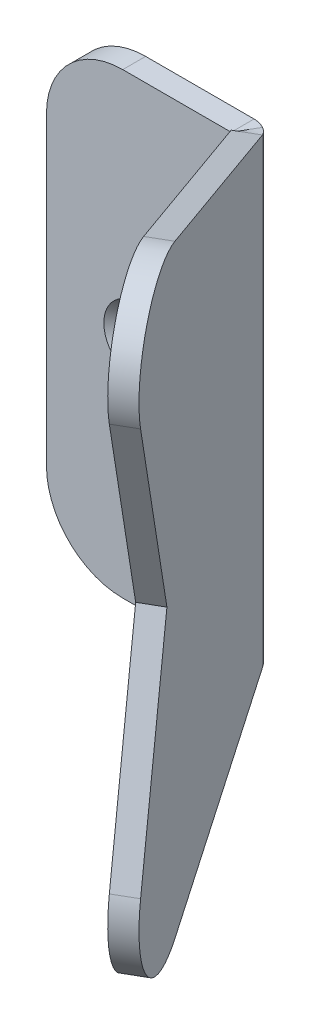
ISO-10303-21;
HEADER;
FILE_DESCRIPTION(('STEP AP214'),'2;1');
FILE_NAME('part.step','',(''),(''),'','','');
FILE_SCHEMA(('AUTOMOTIVE_DESIGN { 1 0 10303 214 1 1 1 1 }'));
ENDSEC;
DATA;
#1=APPLICATION_CONTEXT('core data for automotive mechanical design processes');
#2=APPLICATION_PROTOCOL_DEFINITION('international standard','automotive_design',2000,#1);
#3=PRODUCT_CONTEXT('',#1,'mechanical');
#4=PRODUCT('Part','Part','',(#3));
#5=PRODUCT_RELATED_PRODUCT_CATEGORY('part','',(#4));
#6=PRODUCT_DEFINITION_FORMATION('','',#4);
#7=PRODUCT_DEFINITION_CONTEXT('part definition',#1,'design');
#8=PRODUCT_DEFINITION('design','',#6,#7);
#9=PRODUCT_DEFINITION_SHAPE('','',#8);
#10=(LENGTH_UNIT() NAMED_UNIT(*) SI_UNIT(.MILLI.,.METRE.));
#11=(NAMED_UNIT(*) PLANE_ANGLE_UNIT() SI_UNIT($,.RADIAN.));
#12=(NAMED_UNIT(*) SI_UNIT($,.STERADIAN.) SOLID_ANGLE_UNIT());
#13=UNCERTAINTY_MEASURE_WITH_UNIT(LENGTH_MEASURE(1.E-05),#10,'distance_accuracy_value','');
#14=(GEOMETRIC_REPRESENTATION_CONTEXT(3) GLOBAL_UNCERTAINTY_ASSIGNED_CONTEXT((#13)) GLOBAL_UNIT_ASSIGNED_CONTEXT((#10,
#11,#12)) REPRESENTATION_CONTEXT('',''));
#15=CARTESIAN_POINT('',(0.,0.,0.));
#16=DIRECTION('',(0.,0.,1.));
#17=DIRECTION('',(1.,0.,0.));
#18=AXIS2_PLACEMENT_3D('',#15,#16,#17);
#19=CARTESIAN_POINT('',(43.9200595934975,30.,28.1307609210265));
#20=DIRECTION('',(-0.86602540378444,0.,0.499999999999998));
#21=DIRECTION('',(0.499999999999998,0.,0.86602540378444));
#22=AXIS2_PLACEMENT_3D('',#19,#20,#21);
#23=PLANE('',#22);
#24=DIRECTION('',(0.479157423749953,-0.285714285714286,0.829925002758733));
#25=VECTOR('',#24,1.);
#26=CARTESIAN_POINT('',(26.4200595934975,-30.,-2.18012821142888));
#27=LINE('',#26,#25);
#28=CARTESIAN_POINT('',(26.8130204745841,-30.2343165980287,-1.49949999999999));
#29=VERTEX_POINT('',#28);
#30=CARTESIAN_POINT('',(42.491488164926,-39.5831484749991,25.6564026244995));
#31=VERTEX_POINT('',#30);
#32=EDGE_CURVE('E141',#29,#31,#27,.T.);
#33=ORIENTED_EDGE('',*,*,#32,.F.);
#34=DIRECTION('',(0.,1.,0.));
#35=VECTOR('',#34,1.);
#36=CARTESIAN_POINT('',(26.8130204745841,30.,-1.49949999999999));
#37=LINE('',#36,#35);
#38=CARTESIAN_POINT('',(26.8130204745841,30.2343165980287,-1.49949999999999));
#39=VERTEX_POINT('',#38);
#40=EDGE_CURVE('E140',#29,#39,#37,.T.);
#41=ORIENTED_EDGE('',*,*,#40,.T.);
#42=DIRECTION('',(-0.479157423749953,-0.285714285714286,-0.829925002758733));
#43=VECTOR('',#42,1.);
#44=CARTESIAN_POINT('',(26.4200595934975,30.,-2.18012821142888));
#45=LINE('',#44,#43);
#46=CARTESIAN_POINT('',(42.491488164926,39.5831484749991,25.6564026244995));
#47=VERTEX_POINT('',#46);
#48=EDGE_CURVE('E125',#47,#39,#45,.T.);
#49=ORIENTED_EDGE('',*,*,#48,.F.);
#50=CARTESIAN_POINT('',(43.9200595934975,30.,28.1307609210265));
#51=DIRECTION('',(-0.86602540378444,0.,0.499999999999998));
#52=DIRECTION('',(0.499999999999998,0.,0.86602540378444));
#53=AXIS2_PLACEMENT_3D('',#50,#51,#52);
#54=CIRCLE('',#53,10.);
#55=CARTESIAN_POINT('',(48.6341048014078,26.6666666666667,36.2957267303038));
#56=VERTEX_POINT('',#55);
#57=EDGE_CURVE('E139',#56,#47,#54,.T.);
#58=ORIENTED_EDGE('',*,*,#57,.F.);
#59=DIRECTION('',(0.166666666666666,0.942809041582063,0.288675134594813));
#60=VECTOR('',#59,1.);
#61=CARTESIAN_POINT('',(48.6341048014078,26.6666666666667,36.2957267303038));
#62=LINE('',#61,#60);
#63=CARTESIAN_POINT('',(43.9200595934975,0.,28.1307609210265));
#64=VERTEX_POINT('',#63);
#65=EDGE_CURVE('E144',#64,#56,#62,.T.);
#66=ORIENTED_EDGE('',*,*,#65,.F.);
#67=DIRECTION('',(-0.166666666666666,0.942809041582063,-0.288675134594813));
#68=VECTOR('',#67,1.);
#69=CARTESIAN_POINT('',(48.6341048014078,-26.6666666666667,36.2957267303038));
#70=LINE('',#69,#68);
#71=CARTESIAN_POINT('',(48.6341048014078,-26.6666666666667,36.2957267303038));
#72=VERTEX_POINT('',#71);
#73=EDGE_CURVE('E146',#72,#64,#70,.T.);
#74=ORIENTED_EDGE('',*,*,#73,.F.);
#75=CARTESIAN_POINT('',(43.9200595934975,-30.,28.1307609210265));
#76=DIRECTION('',(-0.86602540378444,0.,0.499999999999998));
#77=DIRECTION('',(-0.499999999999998,0.,-0.86602540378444));
#78=AXIS2_PLACEMENT_3D('',#75,#76,#77);
#79=CIRCLE('',#78,10.);
#80=EDGE_CURVE('E150',#31,#72,#79,.T.);
#81=ORIENTED_EDGE('',*,*,#80,.F.);
#82=EDGE_LOOP('',(#33,#41,#49,#58,#66,#74,#81));
#83=FACE_BOUND('',#82,.T.);
#84=ADVANCED_FACE('F54',(#83),#23,.F.);
#85=CARTESIAN_POINT('',(48.6341048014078,-26.6666666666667,36.2957267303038));
#86=DIRECTION('',(0.47140452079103,0.333333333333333,0.816496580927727));
#87=DIRECTION('',(-0.166666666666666,0.942809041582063,-0.288675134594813));
#88=AXIS2_PLACEMENT_3D('',#85,#86,#87);
#89=PLANE('',#88);
#90=DIRECTION('',(-0.166666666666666,0.942809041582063,-0.288675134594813));
#91=VECTOR('',#90,1.);
#92=CARTESIAN_POINT('',(46.0360285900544,-26.6666666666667,37.7957267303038));
#93=LINE('',#92,#91);
#94=CARTESIAN_POINT('',(46.0360285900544,-26.6666666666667,37.7957267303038));
#95=VERTEX_POINT('',#94);
#96=CARTESIAN_POINT('',(41.3219833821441,0.,29.6307609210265));
#97=VERTEX_POINT('',#96);
#98=EDGE_CURVE('E152',#95,#97,#93,.T.);
#99=ORIENTED_EDGE('',*,*,#98,.F.);
#100=DIRECTION('',(-0.86602540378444,0.,0.499999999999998));
#101=VECTOR('',#100,1.);
#102=CARTESIAN_POINT('',(48.6341048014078,-26.6666666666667,36.2957267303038));
#103=LINE('',#102,#101);
#104=EDGE_CURVE('E81',#72,#95,#103,.T.);
#105=ORIENTED_EDGE('',*,*,#104,.F.);
#106=ORIENTED_EDGE('',*,*,#73,.T.);
#107=DIRECTION('',(-0.86602540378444,0.,0.499999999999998));
#108=VECTOR('',#107,1.);
#109=CARTESIAN_POINT('',(43.9200595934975,0.,28.1307609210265));
#110=LINE('',#109,#108);
#111=EDGE_CURVE('E111',#64,#97,#110,.T.);
#112=ORIENTED_EDGE('',*,*,#111,.T.);
#113=EDGE_LOOP('',(#99,#105,#106,#112));
#114=FACE_BOUND('',#113,.T.);
#115=ADVANCED_FACE('F353',(#114),#89,.T.);
#116=CARTESIAN_POINT('',(43.9200595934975,-30.,28.1307609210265));
#117=DIRECTION('',(-0.86602540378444,0.,0.499999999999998));
#118=DIRECTION('',(0.499999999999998,0.,0.86602540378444));
#119=AXIS2_PLACEMENT_3D('',#116,#117,#118);
#120=CYLINDRICAL_SURFACE('',#119,10.);
#121=CARTESIAN_POINT('',(41.3219833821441,-30.,29.6307609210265));
#122=DIRECTION('',(-0.86602540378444,0.,0.499999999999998));
#123=DIRECTION('',(-0.499999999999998,0.,-0.86602540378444));
#124=AXIS2_PLACEMENT_3D('',#121,#122,#123);
#125=CIRCLE('',#124,10.);
#126=CARTESIAN_POINT('',(39.8934119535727,-39.5831484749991,27.1564026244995));
#127=VERTEX_POINT('',#126);
#128=EDGE_CURVE('E161',#127,#95,#125,.T.);
#129=ORIENTED_EDGE('',*,*,#128,.F.);
#130=DIRECTION('',(-0.86602540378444,0.,0.499999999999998));
#131=VECTOR('',#130,1.);
#132=CARTESIAN_POINT('',(42.491488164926,-39.5831484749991,25.6564026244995));
#133=LINE('',#132,#131);
#134=EDGE_CURVE('E132',#31,#127,#133,.T.);
#135=ORIENTED_EDGE('',*,*,#134,.F.);
#136=ORIENTED_EDGE('',*,*,#80,.T.);
#137=ORIENTED_EDGE('',*,*,#104,.T.);
#138=EDGE_LOOP('',(#129,#135,#136,#137));
#139=FACE_BOUND('',#138,.T.);
#140=ADVANCED_FACE('F197',(#139),#120,.T.);
#141=CARTESIAN_POINT('',(26.4200595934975,-30.,-2.18012821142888));
#142=DIRECTION('',(-0.142857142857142,-0.95831484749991,-0.247435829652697));
#143=DIRECTION('',(0.479157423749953,-0.285714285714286,0.829925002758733));
#144=AXIS2_PLACEMENT_3D('',#141,#142,#143);
#145=PLANE('',#144);
#146=CARTESIAN_POINT('',(26.8130204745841,-30.2343165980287,-1.49949999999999));
#147=CARTESIAN_POINT('',(24.2149442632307,-30.2343165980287,0.000500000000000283));
#148=B_SPLINE_CURVE_WITH_KNOTS('',1,(#146,#147),.UNSPECIFIED.,.F.,.F.,(2,2),(0.,1.),.UNSPECIFIED.);
#149=CARTESIAN_POINT('',(24.2149442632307,-30.2343165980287,0.00050000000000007));
#150=VERTEX_POINT('',#149);
#151=EDGE_CURVE('E319',#29,#150,#148,.T.);
#152=ORIENTED_EDGE('',*,*,#151,.F.);
#153=ORIENTED_EDGE('',*,*,#32,.T.);
#154=ORIENTED_EDGE('',*,*,#134,.T.);
#155=DIRECTION('',(0.479157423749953,-0.285714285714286,0.829925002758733));
#156=VECTOR('',#155,1.);
#157=CARTESIAN_POINT('',(23.8219833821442,-30.,-0.68012821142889));
#158=LINE('',#157,#156);
#159=EDGE_CURVE('E164',#150,#127,#158,.T.);
#160=ORIENTED_EDGE('',*,*,#159,.F.);
#161=EDGE_LOOP('',(#152,#153,#154,#160));
#162=FACE_BOUND('',#161,.T.);
#163=ADVANCED_FACE('F193',(#162),#145,.T.);
#164=CARTESIAN_POINT('',(26.4200595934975,30.,-2.18012821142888));
#165=DIRECTION('',(-0.142857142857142,0.95831484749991,-0.247435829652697));
#166=DIRECTION('',(-0.479157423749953,-0.285714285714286,-0.829925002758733));
#167=AXIS2_PLACEMENT_3D('',#164,#165,#166);
#168=PLANE('',#167);
#169=CARTESIAN_POINT('',(24.2149442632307,30.2343165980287,0.000499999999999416));
#170=CARTESIAN_POINT('',(26.8130204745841,30.2343165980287,-1.49949999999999));
#171=B_SPLINE_CURVE_WITH_KNOTS('',1,(#169,#170),.UNSPECIFIED.,.F.,.F.,(2,2),(0.,1.),.UNSPECIFIED.);
#172=CARTESIAN_POINT('',(24.2149442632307,30.2343165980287,0.000500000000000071));
#173=VERTEX_POINT('',#172);
#174=EDGE_CURVE('E12',#173,#39,#171,.T.);
#175=ORIENTED_EDGE('',*,*,#174,.F.);
#176=DIRECTION('',(-0.479157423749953,-0.285714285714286,-0.829925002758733));
#177=VECTOR('',#176,1.);
#178=CARTESIAN_POINT('',(23.8219833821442,30.,-0.68012821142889));
#179=LINE('',#178,#177);
#180=CARTESIAN_POINT('',(39.8934119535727,39.5831484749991,27.1564026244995));
#181=VERTEX_POINT('',#180);
#182=EDGE_CURVE('E127',#181,#173,#179,.T.);
#183=ORIENTED_EDGE('',*,*,#182,.F.);
#184=DIRECTION('',(-0.86602540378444,0.,0.499999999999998));
#185=VECTOR('',#184,1.);
#186=CARTESIAN_POINT('',(42.491488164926,39.5831484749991,25.6564026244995));
#187=LINE('',#186,#185);
#188=EDGE_CURVE('E122',#47,#181,#187,.T.);
#189=ORIENTED_EDGE('',*,*,#188,.F.);
#190=ORIENTED_EDGE('',*,*,#48,.T.);
#191=EDGE_LOOP('',(#175,#183,#189,#190));
#192=FACE_BOUND('',#191,.T.);
#193=ADVANCED_FACE('F56',(#192),#168,.T.);
#194=CARTESIAN_POINT('',(43.9200595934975,30.,28.1307609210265));
#195=DIRECTION('',(-0.86602540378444,0.,0.499999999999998));
#196=DIRECTION('',(0.499999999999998,0.,0.86602540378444));
#197=AXIS2_PLACEMENT_3D('',#194,#195,#196);
#198=CYLINDRICAL_SURFACE('',#197,10.);
#199=CARTESIAN_POINT('',(41.3219833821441,30.,29.6307609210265));
#200=DIRECTION('',(-0.86602540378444,0.,0.499999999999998));
#201=DIRECTION('',(0.499999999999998,0.,0.86602540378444));
#202=AXIS2_PLACEMENT_3D('',#199,#200,#201);
#203=CIRCLE('',#202,10.);
#204=CARTESIAN_POINT('',(46.0360285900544,26.6666666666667,37.7957267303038));
#205=VERTEX_POINT('',#204);
#206=EDGE_CURVE('E159',#205,#181,#203,.T.);
#207=ORIENTED_EDGE('',*,*,#206,.F.);
#208=DIRECTION('',(-0.86602540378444,0.,0.499999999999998));
#209=VECTOR('',#208,1.);
#210=CARTESIAN_POINT('',(48.6341048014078,26.6666666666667,36.2957267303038));
#211=LINE('',#210,#209);
#212=EDGE_CURVE('E133',#56,#205,#211,.T.);
#213=ORIENTED_EDGE('',*,*,#212,.F.);
#214=ORIENTED_EDGE('',*,*,#57,.T.);
#215=ORIENTED_EDGE('',*,*,#188,.T.);
#216=EDGE_LOOP('',(#207,#213,#214,#215));
#217=FACE_BOUND('',#216,.T.);
#218=ADVANCED_FACE('F143',(#217),#198,.T.);
#219=CARTESIAN_POINT('',(48.6341048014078,26.6666666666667,36.2957267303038));
#220=DIRECTION('',(0.47140452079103,-0.333333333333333,0.816496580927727));
#221=DIRECTION('',(0.166666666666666,0.942809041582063,0.288675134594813));
#222=AXIS2_PLACEMENT_3D('',#219,#220,#221);
#223=PLANE('',#222);
#224=DIRECTION('',(0.166666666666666,0.942809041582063,0.288675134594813));
#225=VECTOR('',#224,1.);
#226=CARTESIAN_POINT('',(46.0360285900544,26.6666666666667,37.7957267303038));
#227=LINE('',#226,#225);
#228=EDGE_CURVE('E155',#97,#205,#227,.T.);
#229=ORIENTED_EDGE('',*,*,#228,.F.);
#230=ORIENTED_EDGE('',*,*,#111,.F.);
#231=ORIENTED_EDGE('',*,*,#65,.T.);
#232=ORIENTED_EDGE('',*,*,#212,.T.);
#233=EDGE_LOOP('',(#229,#230,#231,#232));
#234=FACE_BOUND('',#233,.T.);
#235=ADVANCED_FACE('F192',(#234),#223,.T.);
#236=CARTESIAN_POINT('',(41.3219833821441,30.,29.6307609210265));
#237=DIRECTION('',(-0.86602540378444,0.,0.499999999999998));
#238=DIRECTION('',(0.499999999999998,0.,0.86602540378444));
#239=AXIS2_PLACEMENT_3D('',#236,#237,#238);
#240=PLANE('',#239);
#241=CARTESIAN_POINT('',(24.2149442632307,-30.2343165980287,0.000500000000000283));
#242=CARTESIAN_POINT('',(24.2148569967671,-30.1562110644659,0.000348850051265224));
#243=CARTESIAN_POINT('',(24.2147293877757,-30.0781055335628,0.000221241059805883));
#244=CARTESIAN_POINT('',(24.214578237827,-30.,0.000133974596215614));
#245=B_SPLINE_CURVE_WITH_KNOTS('',3,(#241,#242,#243,#244),.UNSPECIFIED.,.F.,.F.,(4,4),(0.,1.),.UNSPECIFIED.);
#246=CARTESIAN_POINT('',(24.214740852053,-30.,0.000356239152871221));
#247=VERTEX_POINT('',#246);
#248=EDGE_CURVE('E65',#150,#247,#245,.T.);
#249=ORIENTED_EDGE('',*,*,#248,.F.);
#250=ORIENTED_EDGE('',*,*,#159,.T.);
#251=ORIENTED_EDGE('',*,*,#128,.T.);
#252=ORIENTED_EDGE('',*,*,#98,.T.);
#253=ORIENTED_EDGE('',*,*,#228,.T.);
#254=ORIENTED_EDGE('',*,*,#206,.T.);
#255=ORIENTED_EDGE('',*,*,#182,.T.);
#256=CARTESIAN_POINT('',(24.214578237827,30.,0.000133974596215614));
#257=CARTESIAN_POINT('',(24.2147293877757,30.0781055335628,0.000221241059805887));
#258=CARTESIAN_POINT('',(24.2148569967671,30.1562110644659,0.000348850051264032));
#259=CARTESIAN_POINT('',(24.2149442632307,30.2343165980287,0.000499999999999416));
#260=B_SPLINE_CURVE_WITH_KNOTS('',3,(#256,#257,#258,#259),.UNSPECIFIED.,.F.,.F.,(4,4),(0.,1.),.UNSPECIFIED.);
#261=CARTESIAN_POINT('',(24.2146374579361,30.,0.000283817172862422));
#262=VERTEX_POINT('',#261);
#263=EDGE_CURVE('E221',#173,#262,#260,.F.);
#264=ORIENTED_EDGE('',*,*,#263,.T.);
#265=CARTESIAN_POINT('',(24.2140782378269,-30.,0.));
#266=DIRECTION('',(0.,1.,0.));
#267=VECTOR('',#266,1.);
#268=LINE('',#265,#267);
#269=EDGE_CURVE('E311',#247,#262,#268,.T.);
#270=ORIENTED_EDGE('',*,*,#269,.F.);
#271=EDGE_LOOP('',(#249,#250,#251,#252,#253,#254,#255,#264,#270));
#272=FACE_BOUND('',#271,.T.);
#273=ADVANCED_FACE('F182',(#272),#240,.T.);
#274=CARTESIAN_POINT('',(12.,0.,0.));
#275=DIRECTION('',(0.,0.,1.));
#276=DIRECTION('',(1.,0.,0.));
#277=AXIS2_PLACEMENT_3D('',#274,#275,#276);
#278=CONICAL_SURFACE('',#277,4.48,0.785398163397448);
#279=CARTESIAN_POINT('',(12.,0.,-2.23));
#280=DIRECTION('',(0.,0.,1.));
#281=DIRECTION('',(1.,0.,0.));
#282=AXIS2_PLACEMENT_3D('',#279,#280,#281);
#283=CIRCLE('',#282,2.25);
#284=CARTESIAN_POINT('',(14.25,0.,-2.23));
#285=VERTEX_POINT('',#284);
#286=EDGE_CURVE('E544',#285,#285,#283,.T.);
#287=ORIENTED_EDGE('',*,*,#286,.F.);
#288=EDGE_LOOP('',(#287));
#289=FACE_BOUND('',#288,.T.);
#290=CARTESIAN_POINT('',(12.,0.,0.));
#291=DIRECTION('',(0.,0.,1.));
#292=DIRECTION('',(1.,0.,0.));
#293=AXIS2_PLACEMENT_3D('',#290,#291,#292);
#294=CIRCLE('',#293,4.48);
#295=CARTESIAN_POINT('',(16.48,0.,0.));
#296=VERTEX_POINT('',#295);
#297=EDGE_CURVE('E541',#296,#296,#294,.T.);
#298=ORIENTED_EDGE('',*,*,#297,.T.);
#299=EDGE_LOOP('',(#298));
#300=FACE_BOUND('',#299,.T.);
#301=ADVANCED_FACE('F191',(#289,#300),#278,.F.);
#302=CARTESIAN_POINT('',(12.,0.,0.));
#303=DIRECTION('',(0.,0.,1.));
#304=DIRECTION('',(1.,0.,0.));
#305=AXIS2_PLACEMENT_3D('',#302,#303,#304);
#306=CYLINDRICAL_SURFACE('',#305,2.25);
#307=CARTESIAN_POINT('',(12.,0.,-3.));
#308=DIRECTION('',(0.,0.,1.));
#309=DIRECTION('',(1.,0.,0.));
#310=AXIS2_PLACEMENT_3D('',#307,#308,#309);
#311=CIRCLE('',#310,2.25);
#312=CARTESIAN_POINT('',(14.25,0.,-3.));
#313=VERTEX_POINT('',#312);
#314=EDGE_CURVE('E560',#313,#313,#311,.T.);
#315=ORIENTED_EDGE('',*,*,#314,.F.);
#316=EDGE_LOOP('',(#315));
#317=FACE_BOUND('',#316,.T.);
#318=ORIENTED_EDGE('',*,*,#286,.T.);
#319=EDGE_LOOP('',(#318));
#320=FACE_BOUND('',#319,.T.);
#321=ADVANCED_FACE('F457',(#317,#320),#306,.F.);
#322=CARTESIAN_POINT('',(10.,20.,-3.));
#323=DIRECTION('',(0.,0.,1.));
#324=DIRECTION('',(1.,0.,0.));
#325=AXIS2_PLACEMENT_3D('',#322,#323,#324);
#326=CYLINDRICAL_SURFACE('',#325,10.);
#327=CARTESIAN_POINT('',(10.,20.,0.));
#328=DIRECTION('',(0.,0.,1.));
#329=DIRECTION('',(-1.,0.,0.));
#330=AXIS2_PLACEMENT_3D('',#327,#328,#329);
#331=CIRCLE('',#330,10.);
#332=CARTESIAN_POINT('',(10.,30.,0.));
#333=VERTEX_POINT('',#332);
#334=CARTESIAN_POINT('',(0.,20.,0.));
#335=VERTEX_POINT('',#334);
#336=EDGE_CURVE('E527',#333,#335,#331,.T.);
#337=ORIENTED_EDGE('',*,*,#336,.F.);
#338=DIRECTION('',(0.,0.,1.));
#339=VECTOR('',#338,1.);
#340=CARTESIAN_POINT('',(10.,30.,-3.));
#341=LINE('',#340,#339);
#342=CARTESIAN_POINT('',(10.,30.,-3.));
#343=VERTEX_POINT('',#342);
#344=EDGE_CURVE('E156',#343,#333,#341,.T.);
#345=ORIENTED_EDGE('',*,*,#344,.F.);
#346=CARTESIAN_POINT('',(10.,20.,-3.));
#347=DIRECTION('',(0.,0.,1.));
#348=DIRECTION('',(-1.,0.,0.));
#349=AXIS2_PLACEMENT_3D('',#346,#347,#348);
#350=CIRCLE('',#349,10.);
#351=CARTESIAN_POINT('',(0.,20.,-3.));
#352=VERTEX_POINT('',#351);
#353=EDGE_CURVE('E547',#343,#352,#350,.T.);
#354=ORIENTED_EDGE('',*,*,#353,.T.);
#355=DIRECTION('',(0.,0.,1.));
#356=VECTOR('',#355,1.);
#357=CARTESIAN_POINT('',(0.,20.,-3.));
#358=LINE('',#357,#356);
#359=EDGE_CURVE('E395',#352,#335,#358,.T.);
#360=ORIENTED_EDGE('',*,*,#359,.T.);
#361=EDGE_LOOP('',(#337,#345,#354,#360));
#362=FACE_BOUND('',#361,.T.);
#363=ADVANCED_FACE('F453',(#362),#326,.T.);
#364=CARTESIAN_POINT('',(0.,-20.,-3.));
#365=DIRECTION('',(-1.,0.,0.));
#366=DIRECTION('',(0.,0.,1.));
#367=AXIS2_PLACEMENT_3D('',#364,#365,#366);
#368=PLANE('',#367);
#369=DIRECTION('',(0.,-1.,0.));
#370=VECTOR('',#369,1.);
#371=CARTESIAN_POINT('',(0.,-20.,0.));
#372=LINE('',#371,#370);
#373=CARTESIAN_POINT('',(0.,-20.,0.));
#374=VERTEX_POINT('',#373);
#375=EDGE_CURVE('E528',#335,#374,#372,.T.);
#376=ORIENTED_EDGE('',*,*,#375,.F.);
#377=ORIENTED_EDGE('',*,*,#359,.F.);
#378=DIRECTION('',(0.,-1.,0.));
#379=VECTOR('',#378,1.);
#380=CARTESIAN_POINT('',(0.,-20.,-3.));
#381=LINE('',#380,#379);
#382=CARTESIAN_POINT('',(0.,-20.,-3.));
#383=VERTEX_POINT('',#382);
#384=EDGE_CURVE('E550',#352,#383,#381,.T.);
#385=ORIENTED_EDGE('',*,*,#384,.T.);
#386=DIRECTION('',(0.,0.,1.));
#387=VECTOR('',#386,1.);
#388=CARTESIAN_POINT('',(0.,-20.,-3.));
#389=LINE('',#388,#387);
#390=EDGE_CURVE('E553',#383,#374,#389,.T.);
#391=ORIENTED_EDGE('',*,*,#390,.T.);
#392=EDGE_LOOP('',(#376,#377,#385,#391));
#393=FACE_BOUND('',#392,.T.);
#394=ADVANCED_FACE('F449',(#393),#368,.T.);
#395=CARTESIAN_POINT('',(10.,-20.,-3.));
#396=DIRECTION('',(0.,0.,1.));
#397=DIRECTION('',(1.,0.,0.));
#398=AXIS2_PLACEMENT_3D('',#395,#396,#397);
#399=CYLINDRICAL_SURFACE('',#398,10.);
#400=CARTESIAN_POINT('',(10.,-20.,0.));
#401=DIRECTION('',(0.,0.,1.));
#402=DIRECTION('',(1.,0.,0.));
#403=AXIS2_PLACEMENT_3D('',#400,#401,#402);
#404=CIRCLE('',#403,10.);
#405=CARTESIAN_POINT('',(10.,-30.,0.));
#406=VERTEX_POINT('',#405);
#407=EDGE_CURVE('E418',#374,#406,#404,.T.);
#408=ORIENTED_EDGE('',*,*,#407,.F.);
#409=ORIENTED_EDGE('',*,*,#390,.F.);
#410=CARTESIAN_POINT('',(10.,-20.,-3.));
#411=DIRECTION('',(0.,0.,1.));
#412=DIRECTION('',(1.,0.,0.));
#413=AXIS2_PLACEMENT_3D('',#410,#411,#412);
#414=CIRCLE('',#413,10.);
#415=CARTESIAN_POINT('',(10.,-30.,-3.));
#416=VERTEX_POINT('',#415);
#417=EDGE_CURVE('E555',#383,#416,#414,.T.);
#418=ORIENTED_EDGE('',*,*,#417,.T.);
#419=DIRECTION('',(0.,0.,1.));
#420=VECTOR('',#419,1.);
#421=CARTESIAN_POINT('',(10.,-30.,-3.));
#422=LINE('',#421,#420);
#423=EDGE_CURVE('E558',#416,#406,#422,.T.);
#424=ORIENTED_EDGE('',*,*,#423,.T.);
#425=EDGE_LOOP('',(#408,#409,#418,#424));
#426=FACE_BOUND('',#425,.T.);
#427=ADVANCED_FACE('F445',(#426),#399,.T.);
#428=CARTESIAN_POINT('',(60.,30.,-3.));
#429=DIRECTION('',(0.,0.,1.));
#430=DIRECTION('',(1.,0.,0.));
#431=AXIS2_PLACEMENT_3D('',#428,#429,#430);
#432=PLANE('',#431);
#433=DIRECTION('',(0.,1.,0.));
#434=VECTOR('',#433,1.);
#435=CARTESIAN_POINT('',(24.214078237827,30.,-3.));
#436=LINE('',#435,#434);
#437=CARTESIAN_POINT('',(24.214078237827,-30.,-3.));
#438=VERTEX_POINT('',#437);
#439=CARTESIAN_POINT('',(24.2140782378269,30.,-3.));
#440=VERTEX_POINT('',#439);
#441=EDGE_CURVE('E407',#438,#440,#436,.T.);
#442=ORIENTED_EDGE('',*,*,#441,.F.);
#443=DIRECTION('',(1.,0.,0.));
#444=VECTOR('',#443,1.);
#445=CARTESIAN_POINT('',(10.,-30.,-3.));
#446=LINE('',#445,#444);
#447=EDGE_CURVE('E425',#416,#438,#446,.T.);
#448=ORIENTED_EDGE('',*,*,#447,.F.);
#449=ORIENTED_EDGE('',*,*,#417,.F.);
#450=ORIENTED_EDGE('',*,*,#384,.F.);
#451=ORIENTED_EDGE('',*,*,#353,.F.);
#452=DIRECTION('',(-1.,0.,0.));
#453=VECTOR('',#452,1.);
#454=CARTESIAN_POINT('',(10.,30.,-3.));
#455=LINE('',#454,#453);
#456=EDGE_CURVE('E565',#440,#343,#455,.T.);
#457=ORIENTED_EDGE('',*,*,#456,.F.);
#458=EDGE_LOOP('',(#442,#448,#449,#450,#451,#457));
#459=FACE_BOUND('',#458,.T.);
#460=ORIENTED_EDGE('',*,*,#314,.T.);
#461=EDGE_LOOP('',(#460));
#462=FACE_BOUND('',#461,.T.);
#463=ADVANCED_FACE('F442',(#459,#462),#432,.F.);
#464=CARTESIAN_POINT('',(10.,-30.,-3.));
#465=DIRECTION('',(0.,-1.,0.));
#466=DIRECTION('',(0.,0.,-1.));
#467=AXIS2_PLACEMENT_3D('',#464,#465,#466);
#468=PLANE('',#467);
#469=ORIENTED_EDGE('',*,*,#447,.T.);
#470=CARTESIAN_POINT('',(24.214078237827,-30.,-3.));
#471=DIRECTION('',(0.,0.,1.));
#472=VECTOR('',#471,1.);
#473=LINE('',#470,#472);
#474=EDGE_CURVE('E405',#438,#247,#473,.T.);
#475=ORIENTED_EDGE('',*,*,#474,.T.);
#476=DIRECTION('',(1.,0.,0.));
#477=VECTOR('',#476,1.);
#478=CARTESIAN_POINT('',(10.,-30.,0.));
#479=LINE('',#478,#477);
#480=EDGE_CURVE('E414',#406,#247,#479,.T.);
#481=ORIENTED_EDGE('',*,*,#480,.F.);
#482=ORIENTED_EDGE('',*,*,#423,.F.);
#483=EDGE_LOOP('',(#469,#475,#481,#482));
#484=FACE_BOUND('',#483,.T.);
#485=ADVANCED_FACE('F423',(#484),#468,.T.);
#486=CARTESIAN_POINT('',(60.,30.,0.));
#487=DIRECTION('',(0.,0.,1.));
#488=DIRECTION('',(1.,0.,0.));
#489=AXIS2_PLACEMENT_3D('',#486,#487,#488);
#490=PLANE('',#489);
#491=ORIENTED_EDGE('',*,*,#297,.F.);
#492=EDGE_LOOP('',(#491));
#493=FACE_BOUND('',#492,.T.);
#494=ORIENTED_EDGE('',*,*,#480,.T.);
#495=ORIENTED_EDGE('',*,*,#269,.T.);
#496=DIRECTION('',(-1.,0.,0.));
#497=VECTOR('',#496,1.);
#498=CARTESIAN_POINT('',(10.,30.,0.));
#499=LINE('',#498,#497);
#500=EDGE_CURVE('E523',#262,#333,#499,.T.);
#501=ORIENTED_EDGE('',*,*,#500,.T.);
#502=ORIENTED_EDGE('',*,*,#336,.T.);
#503=ORIENTED_EDGE('',*,*,#375,.T.);
#504=ORIENTED_EDGE('',*,*,#407,.T.);
#505=EDGE_LOOP('',(#494,#495,#501,#502,#503,#504));
#506=FACE_BOUND('',#505,.T.);
#507=ADVANCED_FACE('F347',(#493,#506),#490,.T.);
#508=CARTESIAN_POINT('',(10.,30.,-3.));
#509=DIRECTION('',(0.,1.,0.));
#510=DIRECTION('',(0.,0.,1.));
#511=AXIS2_PLACEMENT_3D('',#508,#509,#510);
#512=PLANE('',#511);
#513=ORIENTED_EDGE('',*,*,#500,.F.);
#514=CARTESIAN_POINT('',(24.214078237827,30.,0.));
#515=DIRECTION('',(0.,0.,-1.));
#516=VECTOR('',#515,1.);
#517=LINE('',#514,#516);
#518=EDGE_CURVE('E505',#262,#440,#517,.T.);
#519=ORIENTED_EDGE('',*,*,#518,.T.);
#520=ORIENTED_EDGE('',*,*,#456,.T.);
#521=ORIENTED_EDGE('',*,*,#344,.T.);
#522=EDGE_LOOP('',(#513,#519,#520,#521));
#523=FACE_BOUND('',#522,.T.);
#524=ADVANCED_FACE('F336',(#523),#512,.T.);
#525=CARTESIAN_POINT('',(24.214078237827,-30.,0.00100000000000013));
#526=DIRECTION('',(0.,-1.,0.));
#527=DIRECTION('',(0.,0.,-1.));
#528=AXIS2_PLACEMENT_3D('',#525,#526,#527);
#529=PLANE('',#528);
#530=CARTESIAN_POINT('',(24.214578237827,-30.,0.000133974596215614));
#531=CARTESIAN_POINT('',(25.714578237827,-30.,-2.5979422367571));
#532=B_SPLINE_CURVE_WITH_KNOTS('',1,(#530,#531),.UNSPECIFIED.,.F.,.F.,(2,2),(0.,1.),.UNSPECIFIED.);
#533=CARTESIAN_POINT('',(25.714578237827,-30.,-2.5979422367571));
#534=VERTEX_POINT('',#533);
#535=EDGE_CURVE('E398',#247,#534,#532,.T.);
#536=ORIENTED_EDGE('',*,*,#535,.F.);
#537=ORIENTED_EDGE('',*,*,#474,.F.);
#538=CARTESIAN_POINT('',(24.214078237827,-30.,0.00100000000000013));
#539=DIRECTION('',(0.,1.,0.));
#540=DIRECTION('',(0.,0.,-1.));
#541=AXIS2_PLACEMENT_3D('',#538,#539,#540);
#542=CIRCLE('',#541,3.001);
#543=EDGE_CURVE('E297',#534,#438,#542,.T.);
#544=ORIENTED_EDGE('',*,*,#543,.F.);
#545=EDGE_LOOP('',(#536,#537,#544));
#546=FACE_BOUND('',#545,.T.);
#547=ADVANCED_FACE('F346',(#546),#529,.T.);
#548=CARTESIAN_POINT('',(24.214078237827,30.,0.00100000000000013));
#549=DIRECTION('',(0.,1.,0.));
#550=DIRECTION('',(0.,0.,1.));
#551=AXIS2_PLACEMENT_3D('',#548,#549,#550);
#552=PLANE('',#551);
#553=ORIENTED_EDGE('',*,*,#518,.F.);
#554=CARTESIAN_POINT('',(25.714578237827,30.,-2.5979422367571));
#555=CARTESIAN_POINT('',(24.214578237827,30.,0.000133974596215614));
#556=B_SPLINE_CURVE_WITH_KNOTS('',1,(#554,#555),.UNSPECIFIED.,.F.,.F.,(2,2),(0.,1.),.UNSPECIFIED.);
#557=CARTESIAN_POINT('',(25.714578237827,30.,-2.5979422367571));
#558=VERTEX_POINT('',#557);
#559=EDGE_CURVE('E408',#262,#558,#556,.F.);
#560=ORIENTED_EDGE('',*,*,#559,.T.);
#561=CARTESIAN_POINT('',(24.214078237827,30.,0.00100000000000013));
#562=DIRECTION('',(0.,-1.,0.));
#563=DIRECTION('',(0.,0.,1.));
#564=AXIS2_PLACEMENT_3D('',#561,#562,#563);
#565=CIRCLE('',#564,3.001);
#566=EDGE_CURVE('E303',#440,#558,#565,.T.);
#567=ORIENTED_EDGE('',*,*,#566,.F.);
#568=EDGE_LOOP('',(#553,#560,#567));
#569=FACE_BOUND('',#568,.T.);
#570=ADVANCED_FACE('F247',(#569),#552,.T.);
#571=CARTESIAN_POINT('',(25.714578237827,30.,-2.5979422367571));
#572=CARTESIAN_POINT('',(26.1689020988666,30.0782300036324,-2.3356382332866));
#573=CARTESIAN_POINT('',(26.5507164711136,30.1560865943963,-1.95382386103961));
#574=CARTESIAN_POINT('',(26.8130204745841,30.2343165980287,-1.49949999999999));
#575=CARTESIAN_POINT('',(24.214578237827,30.,0.000133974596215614));
#576=CARTESIAN_POINT('',(24.2147293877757,30.0781055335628,0.000221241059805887));
#577=CARTESIAN_POINT('',(24.2148569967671,30.1562110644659,0.000348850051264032));
#578=CARTESIAN_POINT('',(24.2149442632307,30.2343165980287,0.000499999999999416));
#579=B_SPLINE_SURFACE_WITH_KNOTS('',1,3,((#571,#572,#573,#574),(#575,#576,#577,#578)),
.UNSPECIFIED.,.F.,.F.,.F.,(2,2),(4,4),(0.,1.),(0.,1.),.UNSPECIFIED.);
#580=CARTESIAN_POINT('',(26.8130204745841,30.2343165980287,-1.49949999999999));
#581=CARTESIAN_POINT('',(26.5507164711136,30.1560865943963,-1.95382386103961));
#582=CARTESIAN_POINT('',(26.1689020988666,30.0782300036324,-2.3356382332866));
#583=CARTESIAN_POINT('',(25.714578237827,30.,-2.5979422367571));
#584=B_SPLINE_CURVE_WITH_KNOTS('',3,(#580,#581,#582,#583),.UNSPECIFIED.,.F.,.F.,(4,4),(0.,1.),.UNSPECIFIED.);
#585=EDGE_CURVE('E72',#558,#39,#584,.F.);
#586=ORIENTED_EDGE('',*,*,#559,.F.);
#587=ORIENTED_EDGE('',*,*,#263,.F.);
#588=ORIENTED_EDGE('',*,*,#174,.T.);
#589=ORIENTED_EDGE('',*,*,#585,.F.);
#590=EDGE_LOOP('',(#586,#587,#588,#589));
#591=FACE_BOUND('',#590,.T.);
#592=ADVANCED_FACE('F217',(#591),#579,.T.);
#593=CARTESIAN_POINT('',(26.8130204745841,-30.2343165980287,-1.49949999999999));
#594=CARTESIAN_POINT('',(26.5507164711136,-30.1560865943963,-1.95382386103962));
#595=CARTESIAN_POINT('',(26.1689020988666,-30.0782300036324,-2.3356382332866));
#596=CARTESIAN_POINT('',(25.714578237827,-30.,-2.5979422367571));
#597=CARTESIAN_POINT('',(24.2149442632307,-30.2343165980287,0.000500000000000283));
#598=CARTESIAN_POINT('',(24.2148569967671,-30.1562110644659,0.000348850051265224));
#599=CARTESIAN_POINT('',(24.2147293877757,-30.0781055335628,0.000221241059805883));
#600=CARTESIAN_POINT('',(24.214578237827,-30.,0.000133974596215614));
#601=B_SPLINE_SURFACE_WITH_KNOTS('',1,3,((#593,#594,#595,#596),(#597,#598,#599,#600)),
.UNSPECIFIED.,.F.,.F.,.F.,(2,2),(4,4),(0.,1.),(0.,1.),.UNSPECIFIED.);
#602=CARTESIAN_POINT('',(25.714578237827,-30.,-2.5979422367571));
#603=CARTESIAN_POINT('',(26.1689020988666,-30.0782300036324,-2.3356382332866));
#604=CARTESIAN_POINT('',(26.5507164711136,-30.1560865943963,-1.95382386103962));
#605=CARTESIAN_POINT('',(26.8130204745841,-30.2343165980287,-1.49949999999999));
#606=B_SPLINE_CURVE_WITH_KNOTS('',3,(#602,#603,#604,#605),.UNSPECIFIED.,.F.,.F.,(4,4),(0.,1.),.UNSPECIFIED.);
#607=EDGE_CURVE('E279',#29,#534,#606,.F.);
#608=ORIENTED_EDGE('',*,*,#248,.T.);
#609=ORIENTED_EDGE('',*,*,#535,.T.);
#610=ORIENTED_EDGE('',*,*,#607,.F.);
#611=ORIENTED_EDGE('',*,*,#151,.T.);
#612=EDGE_LOOP('',(#608,#609,#610,#611));
#613=FACE_BOUND('',#612,.T.);
#614=ADVANCED_FACE('F246',(#613),#601,.T.);
#615=CARTESIAN_POINT('',(24.214078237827,60.5634072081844,0.00100000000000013));
#616=DIRECTION('',(0.,-1.,0.));
#617=DIRECTION('',(0.,0.,-1.));
#618=AXIS2_PLACEMENT_3D('',#615,#616,#617);
#619=CYLINDRICAL_SURFACE('',#618,3.001);
#620=ORIENTED_EDGE('',*,*,#40,.F.);
#621=ORIENTED_EDGE('',*,*,#607,.T.);
#622=ORIENTED_EDGE('',*,*,#543,.T.);
#623=ORIENTED_EDGE('',*,*,#441,.T.);
#624=ORIENTED_EDGE('',*,*,#566,.T.);
#625=ORIENTED_EDGE('',*,*,#585,.T.);
#626=EDGE_LOOP('',(#620,#621,#622,#623,#624,#625));
#627=FACE_BOUND('',#626,.T.);
#628=ADVANCED_FACE('F248',(#627),#619,.T.);
#629=CLOSED_SHELL('',(#84,#115,#140,#163,#193,#218,#235,#273,#301,#321,#363,#394,#427,#463,#485,
#507,#524,#547,#570,#592,#614,#628));
#630=MANIFOLD_SOLID_BREP('B2',#629);
#631=ADVANCED_BREP_SHAPE_REPRESENTATION('',(#18,#630),#14);
#632=SHAPE_DEFINITION_REPRESENTATION(#9,#631);
ENDSEC;
END-ISO-10303-21;
